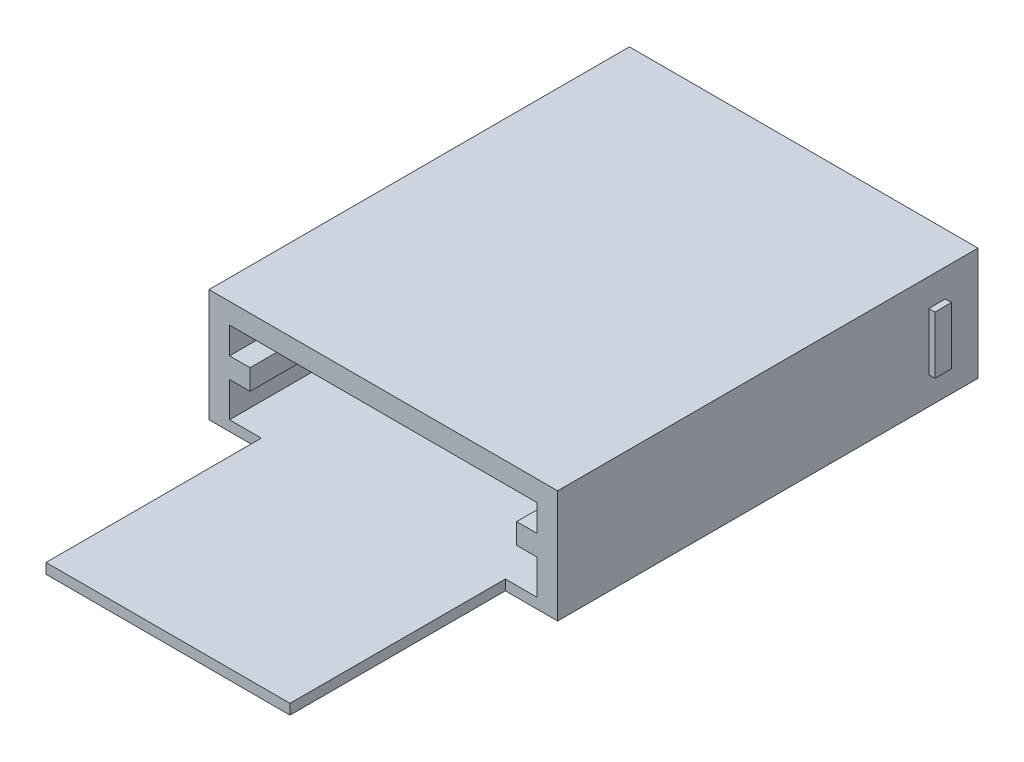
from build123d import *

# Parameters (mm, degrees)
BOSS_EXTRUDE1_DEPTH      = 0.5
BOSS_EXTRUDE2_DEPTH      = 5
BOSS_EXTRUDE2_DEPTH_BACK = 0.5
SKETCH3_W                = 17
SKETCH3_H                = 20.5
BOSS_EXTRUDE3_DEPTH      = 1
SKETCH4_W                = 15
SKETCH4_H                = 4
CUT_EXTRUDE1_DEPTH       = 1
SKETCH6_W                = 0.8
SKETCH6_H                = 2.8
BOSS_EXTRUDE4_DEPTH      = 0.3
SKETCH7_W                = 0.8
SKETCH7_H                = 2.8
BOSS_EXTRUDE5_DEPTH      = 0.3
SKETCH8_W                = 1
SKETCH8_H                = 1
BOSS_EXTRUDE6_DEPTH      = 20.5


with BuildPart() as part:
    # Sketch1 → Boss-Extrude1 (new body)
    with BuildSketch(Plane(origin=(0, 0, 0), x_dir=(1, 0, 0), z_dir=(0, 1, 0))):
        Polygon((-5.95, -4.5), (-7.5, -4.5), (-7.5, 15), (7.5, 15), (7.5, -4.5), (5.95, -4.5), (5.95, -15), (-5.95, -15), align=None)
    extrude(amount=BOSS_EXTRUDE1_DEPTH)

    # Sketch2 → Boss-Extrude2 (add, two sides: drawn at the far end of the back side and taken through both)
    with BuildSketch(Plane(origin=(0, 0.5, 0), x_dir=(1, 0, 0), z_dir=(0, 1, 0)).offset(-BOSS_EXTRUDE2_DEPTH_BACK)):
        Polygon((-7.5, -4.5), (-7.5, 15), (7.5, 15), (7.5, -4.5), (8.5, -4.5), (8.5, 16), (-8.5, 16), (-8.5, -4.5), align=None)
    extrude(amount=BOSS_EXTRUDE2_DEPTH + BOSS_EXTRUDE2_DEPTH_BACK)

    # Sketch3 → Boss-Extrude3 (add)
    with BuildSketch(Plane(origin=(0, 5.5, 0), x_dir=(1, 0, 0), z_dir=(0, 1, 0))):
        with Locations((0, 5.75)):
            Rectangle(SKETCH3_W, SKETCH3_H)
    extrude(amount=-BOSS_EXTRUDE3_DEPTH)

    # Sketch4 → Cut-Extrude1 (cut)
    with BuildSketch(Plane(origin=(0, 0, -16), x_dir=(-1, 0, 0), z_dir=(0, 0, -1))):
        with Locations((0, 2.5)):
            Rectangle(SKETCH4_W, SKETCH4_H)
    extrude(amount=-CUT_EXTRUDE1_DEPTH, mode=Mode.SUBTRACT)

    # Sketch6 → Boss-Extrude4 (add)
    with BuildSketch(Plane(origin=(8.5, 0, 0), x_dir=(0, 0, -1), z_dir=(1, 0, 0))):
        with Locations((14, 2.75)):
            Rectangle(SKETCH6_W, SKETCH6_H)
    extrude(amount=BOSS_EXTRUDE4_DEPTH)

    # Sketch7 → Boss-Extrude5 (add)
    with BuildSketch(Plane.ZY.offset(8.5)):
        with Locations((-14, 2.75)):
            Rectangle(SKETCH7_W, SKETCH7_H)
    extrude(amount=BOSS_EXTRUDE5_DEPTH)

    # Sketch8 → Boss-Extrude6 (add)
    with BuildSketch(Plane.XY.offset(4.5)):
        with Locations((-7, 2.7)):
            Rectangle(SKETCH8_W, SKETCH8_H)
        with Locations((7, 2.7)):
            Rectangle(SKETCH8_W, SKETCH8_H)
    extrude(amount=-BOSS_EXTRUDE6_DEPTH)


solid = part.part
